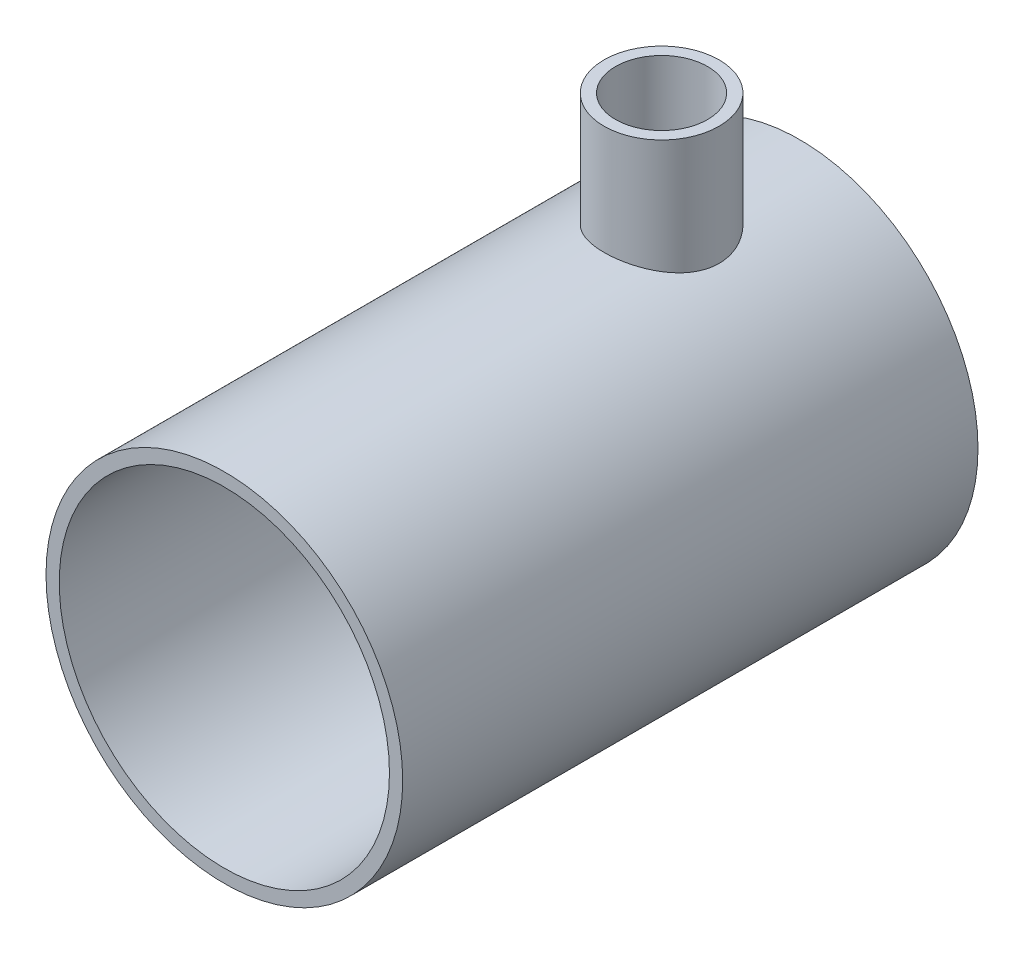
ISO-10303-21;
HEADER;
FILE_DESCRIPTION(('STEP AP214'),'2;1');
FILE_NAME('part.step','',(''),(''),'','','');
FILE_SCHEMA(('AUTOMOTIVE_DESIGN { 1 0 10303 214 1 1 1 1 }'));
ENDSEC;
DATA;
#1=APPLICATION_CONTEXT('core data for automotive mechanical design processes');
#2=APPLICATION_PROTOCOL_DEFINITION('international standard','automotive_design',2000,#1);
#3=PRODUCT_CONTEXT('',#1,'mechanical');
#4=PRODUCT('Part','Part','',(#3));
#5=PRODUCT_RELATED_PRODUCT_CATEGORY('part','',(#4));
#6=PRODUCT_DEFINITION_FORMATION('','',#4);
#7=PRODUCT_DEFINITION_CONTEXT('part definition',#1,'design');
#8=PRODUCT_DEFINITION('design','',#6,#7);
#9=PRODUCT_DEFINITION_SHAPE('','',#8);
#10=(LENGTH_UNIT() NAMED_UNIT(*) SI_UNIT(.MILLI.,.METRE.));
#11=(NAMED_UNIT(*) PLANE_ANGLE_UNIT() SI_UNIT($,.RADIAN.));
#12=(NAMED_UNIT(*) SI_UNIT($,.STERADIAN.) SOLID_ANGLE_UNIT());
#13=UNCERTAINTY_MEASURE_WITH_UNIT(LENGTH_MEASURE(1.E-05),#10,'distance_accuracy_value','');
#14=(GEOMETRIC_REPRESENTATION_CONTEXT(3) GLOBAL_UNCERTAINTY_ASSIGNED_CONTEXT((#13)) GLOBAL_UNIT_ASSIGNED_CONTEXT((#10,
#11,#12)) REPRESENTATION_CONTEXT('',''));
#15=CARTESIAN_POINT('',(0.,0.,0.));
#16=DIRECTION('',(0.,0.,1.));
#17=DIRECTION('',(1.,0.,0.));
#18=AXIS2_PLACEMENT_3D('',#15,#16,#17);
#19=CARTESIAN_POINT('',(0.,0.,50.));
#20=DIRECTION('',(0.,0.,-1.));
#21=DIRECTION('',(-1.,0.,0.));
#22=AXIS2_PLACEMENT_3D('',#19,#20,#21);
#23=CYLINDRICAL_SURFACE('',#22,15.5);
#24=CARTESIAN_POINT('',(0.,0.,0.));
#25=DIRECTION('',(0.,0.,1.));
#26=DIRECTION('',(1.,0.,0.));
#27=AXIS2_PLACEMENT_3D('',#24,#25,#26);
#28=CIRCLE('',#27,15.5);
#29=CARTESIAN_POINT('',(15.5,0.,0.));
#30=VERTEX_POINT('',#29);
#31=EDGE_CURVE('E37',#30,#30,#28,.T.);
#32=ORIENTED_EDGE('',*,*,#31,.T.);
#33=EDGE_LOOP('',(#32));
#34=FACE_BOUND('',#33,.T.);
#35=CARTESIAN_POINT('',(0.,0.,50.));
#36=DIRECTION('',(0.,0.,1.));
#37=DIRECTION('',(1.,0.,0.));
#38=AXIS2_PLACEMENT_3D('',#35,#36,#37);
#39=CIRCLE('',#38,15.5);
#40=CARTESIAN_POINT('',(15.5,0.,50.));
#41=VERTEX_POINT('',#40);
#42=EDGE_CURVE('E41',#41,#41,#39,.T.);
#43=ORIENTED_EDGE('',*,*,#42,.F.);
#44=EDGE_LOOP('',(#43));
#45=FACE_BOUND('',#44,.T.);
#46=CARTESIAN_POINT('',(0.,15.5,7.));
#47=CARTESIAN_POINT('',(-0.273308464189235,15.4999995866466,7.00000038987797));
#48=CARTESIAN_POINT('',(-0.546623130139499,15.4927037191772,7.02248266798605));
#49=CARTESIAN_POINT('',(-1.08523197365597,15.4643156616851,7.11156330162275));
#50=CARTESIAN_POINT('',(-1.35052480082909,15.4432211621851,7.17816904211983));
#51=CARTESIAN_POINT('',(-1.86524635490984,15.389534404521,7.35299702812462));
#52=CARTESIAN_POINT('',(-2.11469983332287,15.3569606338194,7.46115238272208));
#53=CARTESIAN_POINT('',(-2.59192902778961,15.2836601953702,7.71571638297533));
#54=CARTESIAN_POINT('',(-2.81970089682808,15.242932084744,7.86213180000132));
#55=CARTESIAN_POINT('',(-3.25454580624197,15.1561397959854,8.19409139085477));
#56=CARTESIAN_POINT('',(-3.46081152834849,15.1099537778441,8.38066109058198));
#57=CARTESIAN_POINT('',(-3.83973498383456,15.018139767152,8.78545124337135));
#58=CARTESIAN_POINT('',(-4.01238592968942,14.9725118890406,9.00367807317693));
#59=CARTESIAN_POINT('',(-4.32366580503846,14.8856572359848,9.47270948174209));
#60=CARTESIAN_POINT('',(-4.46126675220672,14.8445799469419,9.72422662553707));
#61=CARTESIAN_POINT('',(-4.69187659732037,14.7733194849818,10.2483713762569));
#62=CARTESIAN_POINT('',(-4.78489812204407,14.743133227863,10.5209929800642));
#63=CARTESIAN_POINT('',(-4.9207189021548,14.6983511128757,11.0704633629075));
#64=CARTESIAN_POINT('',(-4.9650231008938,14.6832894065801,11.3469010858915));
#65=CARTESIAN_POINT('',(-5.00685479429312,14.669081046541,11.9036649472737));
#66=CARTESIAN_POINT('',(-5.00439567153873,14.6699298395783,12.1839899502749));
#67=CARTESIAN_POINT('',(-4.95394348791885,14.6870367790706,12.7279405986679));
#68=CARTESIAN_POINT('',(-4.90788741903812,14.7026393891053,12.9917700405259));
#69=CARTESIAN_POINT('',(-4.77469847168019,14.7464273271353,13.5077360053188));
#70=CARTESIAN_POINT('',(-4.68756096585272,14.7746140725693,13.7598712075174));
#71=CARTESIAN_POINT('',(-4.47336280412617,14.8408797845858,14.2498037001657));
#72=CARTESIAN_POINT('',(-4.34571036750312,14.8791038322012,14.4873217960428));
#73=CARTESIAN_POINT('',(-4.05451678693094,14.961073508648,14.9381905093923));
#74=CARTESIAN_POINT('',(-3.89096581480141,15.0048206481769,15.1515344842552));
#75=CARTESIAN_POINT('',(-3.52320909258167,15.0955129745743,15.5589184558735));
#76=CARTESIAN_POINT('',(-3.31741156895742,15.1425101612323,15.751512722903));
#77=CARTESIAN_POINT('',(-2.87585745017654,15.2325358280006,16.099819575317));
#78=CARTESIAN_POINT('',(-2.64009833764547,15.275563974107,16.255529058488));
#79=CARTESIAN_POINT('',(-2.14239406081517,15.3533075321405,16.5267127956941));
#80=CARTESIAN_POINT('',(-1.88023727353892,15.3879466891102,16.6418220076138));
#81=CARTESIAN_POINT('',(-1.33890004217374,15.4444576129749,16.825868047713));
#82=CARTESIAN_POINT('',(-1.05972515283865,15.4663335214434,16.8948198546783));
#83=CARTESIAN_POINT('',(-0.504532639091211,15.494177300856,16.9820842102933));
#84=CARTESIAN_POINT('',(-0.228852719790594,15.5007590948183,17.0023521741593));
#85=CARTESIAN_POINT('',(0.322009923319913,15.4991009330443,16.9972139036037));
#86=CARTESIAN_POINT('',(0.597192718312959,15.4908633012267,16.9718148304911));
#87=CARTESIAN_POINT('',(1.13157213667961,15.4608962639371,16.8776229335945));
#88=CARTESIAN_POINT('',(1.39099953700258,15.4395342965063,16.81001111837));
#89=CARTESIAN_POINT('',(1.89474114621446,15.3858433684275,16.6347709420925));
#90=CARTESIAN_POINT('',(2.13905345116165,15.3535130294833,16.5271375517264));
#91=CARTESIAN_POINT('',(2.61252171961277,15.2801705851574,16.2718725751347));
#92=CARTESIAN_POINT('',(2.84113683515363,15.2389592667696,16.1232966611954));
#93=CARTESIAN_POINT('',(3.27083673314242,15.1525490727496,15.7914856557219));
#94=CARTESIAN_POINT('',(3.47191356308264,15.10734905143,15.6082405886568));
#95=CARTESIAN_POINT('',(3.84968836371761,15.0156357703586,15.2030937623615));
#96=CARTESIAN_POINT('',(4.02499150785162,14.9691480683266,14.9798825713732));
#97=CARTESIAN_POINT('',(4.33580042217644,14.8821024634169,14.506205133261));
#98=CARTESIAN_POINT('',(4.47130640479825,14.8415445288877,14.2557390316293));
#99=CARTESIAN_POINT('',(4.69792389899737,14.7713785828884,13.734902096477));
#100=CARTESIAN_POINT('',(4.78917156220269,14.7417370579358,13.4645952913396));
#101=CARTESIAN_POINT('',(4.92448763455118,14.6970948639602,12.9112887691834));
#102=CARTESIAN_POINT('',(4.96857554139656,14.6820881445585,12.6282943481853));
#103=CARTESIAN_POINT('',(5.00686161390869,14.669072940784,12.0723052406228));
#104=CARTESIAN_POINT('',(5.0033605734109,14.6702805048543,11.7994854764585));
#105=CARTESIAN_POINT('',(4.952174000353,14.687637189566,11.2585318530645));
#106=CARTESIAN_POINT('',(4.90449079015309,14.7037855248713,10.990397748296));
#107=CARTESIAN_POINT('',(4.76787683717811,14.7486389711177,10.4708380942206));
#108=CARTESIAN_POINT('',(4.67964567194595,14.7771306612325,10.2192087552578));
#109=CARTESIAN_POINT('',(4.46499823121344,14.8433941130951,9.73412744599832));
#110=CARTESIAN_POINT('',(4.33857383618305,14.8811678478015,9.5006793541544));
#111=CARTESIAN_POINT('',(4.04502779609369,14.9636852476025,9.04814254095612));
#112=CARTESIAN_POINT('',(3.87644081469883,15.008652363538,8.83004525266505));
#113=CARTESIAN_POINT('',(3.50588508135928,15.0995070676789,8.42449224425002));
#114=CARTESIAN_POINT('',(3.30390716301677,15.1453949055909,8.23704496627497));
#115=CARTESIAN_POINT('',(2.86365656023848,15.234881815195,7.89140807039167));
#116=CARTESIAN_POINT('',(2.62434750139,15.2783411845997,7.73449809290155));
#117=CARTESIAN_POINT('',(2.12135464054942,15.3562521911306,7.46332540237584));
#118=CARTESIAN_POINT('',(1.85767888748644,15.3907067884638,7.3490486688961));
#119=CARTESIAN_POINT('',(1.33127750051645,15.4448389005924,7.17303437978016));
#120=CARTESIAN_POINT('',(1.06962325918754,15.465337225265,7.10834311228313));
#121=CARTESIAN_POINT('',(0.538646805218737,15.4929163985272,7.02183077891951));
#122=CARTESIAN_POINT('',(0.269326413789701,15.5000004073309,6.99999961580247));
#123=CARTESIAN_POINT('',(0.,15.5,7.));
#124=B_SPLINE_CURVE_WITH_KNOTS('',3,(#46,#47,#48,#49,#50,#51,#52,#53,#54,#55,#56,#57,#58,#59,
#60,#61,#62,#63,#64,#65,#66,#67,#68,#69,#70,#71,#72,#73,#74,#75,#76,#77,#78,#79,#80,#81,#82,#83,
#84,#85,#86,#87,#88,#89,#90,#91,#92,#93,#94,#95,#96,#97,#98,#99,#100,#101,#102,#103,#104,#105,
#106,#107,#108,#109,#110,#111,#112,#113,#114,#115,#116,#117,#118,#119,#120,#121,#122,#123),
.UNSPECIFIED.,.T.,.F.,(4,2,2,2,2,2,2,2,2,2,2,2,2,2,2,2,2,2,2,2,2,2,2,2,2,2,2,2,2,2,2,2,2,2,2,2,
2,2,4),(0.,0.818934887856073,1.63800687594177,2.45576572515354,3.27366940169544,
4.11566491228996,4.95783026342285,5.82241350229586,6.68675170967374,7.52356606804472,
8.36014095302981,9.16120972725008,9.96236875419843,10.7758146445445,11.5894835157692,
12.4427707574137,13.2961297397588,14.1569767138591,15.0175441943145,15.8429218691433,
16.6681701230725,17.4713051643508,18.2745411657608,19.0981285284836,19.921953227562,
20.7807016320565,21.6394454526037,22.4955304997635,23.3512614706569,24.1657736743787,
24.9802430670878,25.7811593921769,26.5822461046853,27.4164224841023,28.2508282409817,
29.1149487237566,29.9787847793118,30.7859781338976,31.5929813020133),.UNSPECIFIED.);
#125=CARTESIAN_POINT('',(0.,15.5,7.));
#126=VERTEX_POINT('',#125);
#127=EDGE_CURVE('E10',#126,#126,#124,.T.);
#128=ORIENTED_EDGE('',*,*,#127,.F.);
#129=EDGE_LOOP('',(#128));
#130=FACE_BOUND('',#129,.T.);
#131=ADVANCED_FACE('F33',(#34,#45,#130),#23,.T.);
#132=CARTESIAN_POINT('',(0.,0.,50.));
#133=DIRECTION('',(0.,0.,-1.));
#134=DIRECTION('',(-1.,0.,0.));
#135=AXIS2_PLACEMENT_3D('',#132,#133,#134);
#136=CYLINDRICAL_SURFACE('',#135,14.35);
#137=CARTESIAN_POINT('',(0.,14.35,16.));
#138=CARTESIAN_POINT('',(0.220133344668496,14.3499970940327,15.9999955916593));
#139=CARTESIAN_POINT('',(0.440312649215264,14.3448852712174,15.9817672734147));
#140=CARTESIAN_POINT('',(0.874304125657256,14.3249906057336,15.9094799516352));
#141=CARTESIAN_POINT('',(1.08811360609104,14.3102037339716,15.8554060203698));
#142=CARTESIAN_POINT('',(1.50304006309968,14.2725869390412,15.713340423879));
#143=CARTESIAN_POINT('',(1.70417381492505,14.249767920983,15.6253947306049));
#144=CARTESIAN_POINT('',(2.08883860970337,14.1984843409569,15.4182589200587));
#145=CARTESIAN_POINT('',(2.2723680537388,14.1700192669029,15.2990659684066));
#146=CARTESIAN_POINT('',(2.6212279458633,14.1097037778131,15.0296576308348));
#147=CARTESIAN_POINT('',(2.7860529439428,14.0777913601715,14.8788016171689));
#148=CARTESIAN_POINT('',(3.08842266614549,14.0145658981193,14.5517173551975));
#149=CARTESIAN_POINT('',(3.22596352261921,13.9832529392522,14.375485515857));
#150=CARTESIAN_POINT('',(3.47239273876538,13.9241301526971,13.9985333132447));
#151=CARTESIAN_POINT('',(3.58068728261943,13.8963981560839,13.7974114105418));
#152=CARTESIAN_POINT('',(3.7617202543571,13.848494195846,13.3789153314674));
#153=CARTESIAN_POINT('',(3.83446591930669,13.8283206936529,13.1615444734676));
#154=CARTESIAN_POINT('',(3.94055714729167,13.7984600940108,12.7223472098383));
#155=CARTESIAN_POINT('',(3.9748246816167,13.7885281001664,12.5007605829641));
#156=CARTESIAN_POINT('',(4.0058630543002,13.7795444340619,12.054778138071));
#157=CARTESIAN_POINT('',(4.00264160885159,13.7804905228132,11.8303829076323));
#158=CARTESIAN_POINT('',(3.95952267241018,13.792937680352,11.3924519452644));
#159=CARTESIAN_POINT('',(3.92075422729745,13.8041138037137,11.1787943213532));
#160=CARTESIAN_POINT('',(3.80945563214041,13.8352395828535,10.7611436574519));
#161=CARTESIAN_POINT('',(3.73692256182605,13.8551899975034,10.5571514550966));
#162=CARTESIAN_POINT('',(3.55926507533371,13.9018928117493,10.1617430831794));
#163=CARTESIAN_POINT('',(3.45375532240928,13.9287249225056,9.97050986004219));
#164=CARTESIAN_POINT('',(3.21340791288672,13.9861265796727,9.60807244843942));
#165=CARTESIAN_POINT('',(3.07856400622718,14.0166969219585,9.43687254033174));
#166=CARTESIAN_POINT('',(2.77766087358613,14.0794710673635,9.11292656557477));
#167=CARTESIAN_POINT('',(2.61065729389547,14.1116941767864,8.96106008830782));
#168=CARTESIAN_POINT('',(2.25315512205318,14.1731662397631,8.68730006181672));
#169=CARTESIAN_POINT('',(2.06265542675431,14.2024150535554,8.56540792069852));
#170=CARTESIAN_POINT('',(1.66212420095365,14.2548514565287,8.35461906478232));
#171=CARTESIAN_POINT('',(1.45199788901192,14.2780073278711,8.26589403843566));
#172=CARTESIAN_POINT('',(1.01901591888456,14.3154200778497,8.12528931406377));
#173=CARTESIAN_POINT('',(0.796163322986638,14.3296790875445,8.07340079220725));
#174=CARTESIAN_POINT('',(0.351551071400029,14.3473640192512,8.00935206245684));
#175=CARTESIAN_POINT('',(0.129976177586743,14.3511155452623,7.99599736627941));
#176=CARTESIAN_POINT('',(-0.312251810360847,14.3483056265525,8.00607942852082));
#177=CARTESIAN_POINT('',(-0.532905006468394,14.3417453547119,8.02951200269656));
#178=CARTESIAN_POINT('',(-0.962677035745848,14.3192603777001,8.11152805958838));
#179=CARTESIAN_POINT('',(-1.17193545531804,14.3035162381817,8.16943419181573));
#180=CARTESIAN_POINT('',(-1.57773932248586,14.2644603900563,8.31795716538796));
#181=CARTESIAN_POINT('',(-1.77428332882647,14.2411478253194,8.40857770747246));
#182=CARTESIAN_POINT('',(-2.15363493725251,14.1887919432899,8.62209818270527));
#183=CARTESIAN_POINT('',(-2.33606953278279,14.1596390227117,8.74563325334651));
#184=CARTESIAN_POINT('',(-2.67803462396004,14.0989660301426,9.02068729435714));
#185=CARTESIAN_POINT('',(-2.83756015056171,14.0674454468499,9.17221231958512));
#186=CARTESIAN_POINT('',(-3.13429362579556,14.0043729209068,9.50453604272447));
#187=CARTESIAN_POINT('',(-3.27065581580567,13.9728503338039,9.68609698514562));
#188=CARTESIAN_POINT('',(-3.51100982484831,13.9144050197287,10.0702004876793));
#189=CARTESIAN_POINT('',(-3.61500286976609,13.8874821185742,10.2727422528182));
#190=CARTESIAN_POINT('',(-3.78689482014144,13.8415984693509,10.6921445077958));
#191=CARTESIAN_POINT('',(-3.85499307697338,13.8225938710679,10.9089182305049));
#192=CARTESIAN_POINT('',(-3.95357558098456,13.7947241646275,11.3514681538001));
#193=CARTESIAN_POINT('',(-3.9840705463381,13.7858561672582,11.5772417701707));
#194=CARTESIAN_POINT('',(-4.00592341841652,13.7795206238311,12.022680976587));
#195=CARTESIAN_POINT('',(-3.99864705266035,13.7816552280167,12.2422748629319));
#196=CARTESIAN_POINT('',(-3.94836404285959,13.7961440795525,12.6769719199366));
#197=CARTESIAN_POINT('',(-3.90535848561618,13.8084980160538,12.8920752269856));
#198=CARTESIAN_POINT('',(-3.78566258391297,13.8417858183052,13.3097873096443));
#199=CARTESIAN_POINT('',(-3.70928689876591,13.8626394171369,13.5124931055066));
#200=CARTESIAN_POINT('',(-3.52526211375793,13.9105725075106,13.9023715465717));
#201=CARTESIAN_POINT('',(-3.41760770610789,13.9376530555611,14.0895415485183));
#202=CARTESIAN_POINT('',(-3.17004928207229,13.9960682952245,14.449491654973));
#203=CARTESIAN_POINT('',(-3.02922549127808,14.0275111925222,14.6216216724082));
#204=CARTESIAN_POINT('',(-2.72104207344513,14.090533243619,14.9402505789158));
#205=CARTESIAN_POINT('',(-2.55367586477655,14.1221124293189,15.0867430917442));
#206=CARTESIAN_POINT('',(-2.19230819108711,14.182757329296,15.3534171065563));
#207=CARTESIAN_POINT('',(-1.99776334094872,14.2117444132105,15.4728817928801));
#208=CARTESIAN_POINT('',(-1.59054484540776,14.2630522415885,15.6772262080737));
#209=CARTESIAN_POINT('',(-1.37788184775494,14.2853768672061,15.7621260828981));
#210=CARTESIAN_POINT('',(-0.971964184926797,14.3182801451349,15.8850490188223));
#211=CARTESIAN_POINT('',(-0.780302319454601,14.3300844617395,15.9280499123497));
#212=CARTESIAN_POINT('',(-0.392438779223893,14.3459452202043,15.9855256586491));
#213=CARTESIAN_POINT('',(-0.196237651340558,14.3500025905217,16.0000039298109));
#214=CARTESIAN_POINT('',(0.,14.35,16.));
#215=B_SPLINE_CURVE_WITH_KNOTS('',3,(#137,#138,#139,#140,#141,#142,#143,#144,#145,#146,#147,
#148,#149,#150,#151,#152,#153,#154,#155,#156,#157,#158,#159,#160,#161,#162,#163,#164,#165,#166,
#167,#168,#169,#170,#171,#172,#173,#174,#175,#176,#177,#178,#179,#180,#181,#182,#183,#184,#185,
#186,#187,#188,#189,#190,#191,#192,#193,#194,#195,#196,#197,#198,#199,#200,#201,#202,#203,#204,
#205,#206,#207,#208,#209,#210,#211,#212,#213,#214),.UNSPECIFIED.,.T.,.F.,(4,2,2,2,2,2,2,2,2,2,2,
2,2,2,2,2,2,2,2,2,2,2,2,2,2,2,2,2,2,2,2,2,2,2,2,2,2,2,4),(0.,0.659679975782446,1.31963484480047,
1.97869713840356,2.63781923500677,3.31184776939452,3.98597178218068,4.67289949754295,
5.35968730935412,6.02964241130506,6.69945962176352,7.34871244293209,7.99802142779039,
8.6552207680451,9.31256027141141,9.99342236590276,10.6743164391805,11.3586878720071,
12.0428953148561,12.7056528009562,13.368334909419,14.0184072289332,14.6685531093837,
15.332288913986,15.9961684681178,16.680640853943,17.3650873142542,18.0456913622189,
18.7261013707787,19.3820844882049,20.0380476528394,20.6879546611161,21.3379720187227,
22.0087393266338,22.6796732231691,23.3667290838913,24.0533839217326,24.6415254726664,
25.2295965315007),.UNSPECIFIED.);
#216=CARTESIAN_POINT('',(0.,14.35,16.));
#217=VERTEX_POINT('',#216);
#218=EDGE_CURVE('E99',#217,#217,#215,.T.);
#219=ORIENTED_EDGE('',*,*,#218,.T.);
#220=EDGE_LOOP('',(#219));
#221=FACE_BOUND('',#220,.T.);
#222=CARTESIAN_POINT('',(0.,0.,0.));
#223=DIRECTION('',(0.,0.,1.));
#224=DIRECTION('',(1.,0.,0.));
#225=AXIS2_PLACEMENT_3D('',#222,#223,#224);
#226=CIRCLE('',#225,14.35);
#227=CARTESIAN_POINT('',(14.35,0.,0.));
#228=VERTEX_POINT('',#227);
#229=EDGE_CURVE('E91',#228,#228,#226,.T.);
#230=ORIENTED_EDGE('',*,*,#229,.F.);
#231=EDGE_LOOP('',(#230));
#232=FACE_BOUND('',#231,.T.);
#233=CARTESIAN_POINT('',(0.,0.,50.));
#234=DIRECTION('',(0.,0.,1.));
#235=DIRECTION('',(1.,0.,0.));
#236=AXIS2_PLACEMENT_3D('',#233,#234,#235);
#237=CIRCLE('',#236,14.35);
#238=CARTESIAN_POINT('',(14.35,0.,50.));
#239=VERTEX_POINT('',#238);
#240=EDGE_CURVE('E53',#239,#239,#237,.T.);
#241=ORIENTED_EDGE('',*,*,#240,.T.);
#242=EDGE_LOOP('',(#241));
#243=FACE_BOUND('',#242,.T.);
#244=ADVANCED_FACE('F64',(#221,#232,#243),#136,.F.);
#245=CARTESIAN_POINT('',(0.,0.,50.));
#246=DIRECTION('',(0.,0.,1.));
#247=DIRECTION('',(1.,0.,0.));
#248=AXIS2_PLACEMENT_3D('',#245,#246,#247);
#249=PLANE('',#248);
#250=ORIENTED_EDGE('',*,*,#42,.T.);
#251=EDGE_LOOP('',(#250));
#252=FACE_BOUND('',#251,.T.);
#253=ORIENTED_EDGE('',*,*,#240,.F.);
#254=EDGE_LOOP('',(#253));
#255=FACE_BOUND('',#254,.T.);
#256=ADVANCED_FACE('F67',(#252,#255),#249,.T.);
#257=CARTESIAN_POINT('',(0.,0.,0.));
#258=DIRECTION('',(0.,0.,1.));
#259=DIRECTION('',(1.,0.,0.));
#260=AXIS2_PLACEMENT_3D('',#257,#258,#259);
#261=PLANE('',#260);
#262=ORIENTED_EDGE('',*,*,#31,.F.);
#263=EDGE_LOOP('',(#262));
#264=FACE_BOUND('',#263,.T.);
#265=ORIENTED_EDGE('',*,*,#229,.T.);
#266=EDGE_LOOP('',(#265));
#267=FACE_BOUND('',#266,.T.);
#268=ADVANCED_FACE('F61',(#264,#267),#261,.F.);
#269=CARTESIAN_POINT('',(0.,25.,12.));
#270=DIRECTION('',(0.,-1.,0.));
#271=DIRECTION('',(0.,0.,-1.));
#272=AXIS2_PLACEMENT_3D('',#269,#270,#271);
#273=CYLINDRICAL_SURFACE('',#272,5.);
#274=CARTESIAN_POINT('',(0.,25.,12.));
#275=DIRECTION('',(0.,1.,0.));
#276=DIRECTION('',(0.,0.,1.));
#277=AXIS2_PLACEMENT_3D('',#274,#275,#276);
#278=CIRCLE('',#277,5.);
#279=CARTESIAN_POINT('',(0.,25.,17.));
#280=VERTEX_POINT('',#279);
#281=EDGE_CURVE('E51',#280,#280,#278,.T.);
#282=ORIENTED_EDGE('',*,*,#281,.F.);
#283=EDGE_LOOP('',(#282));
#284=FACE_BOUND('',#283,.T.);
#285=ORIENTED_EDGE('',*,*,#127,.T.);
#286=EDGE_LOOP('',(#285));
#287=FACE_BOUND('',#286,.T.);
#288=ADVANCED_FACE('F55',(#284,#287),#273,.T.);
#289=CARTESIAN_POINT('',(0.,25.,12.));
#290=DIRECTION('',(0.,1.,0.));
#291=DIRECTION('',(0.,0.,1.));
#292=AXIS2_PLACEMENT_3D('',#289,#290,#291);
#293=PLANE('',#292);
#294=CARTESIAN_POINT('',(0.,25.,12.));
#295=DIRECTION('',(0.,1.,0.));
#296=DIRECTION('',(0.,0.,1.));
#297=AXIS2_PLACEMENT_3D('',#294,#295,#296);
#298=CIRCLE('',#297,4.);
#299=CARTESIAN_POINT('',(0.,25.,16.));
#300=VERTEX_POINT('',#299);
#301=EDGE_CURVE('E95',#300,#300,#298,.T.);
#302=ORIENTED_EDGE('',*,*,#301,.F.);
#303=EDGE_LOOP('',(#302));
#304=FACE_BOUND('',#303,.T.);
#305=ORIENTED_EDGE('',*,*,#281,.T.);
#306=EDGE_LOOP('',(#305));
#307=FACE_BOUND('',#306,.T.);
#308=ADVANCED_FACE('F60',(#304,#307),#293,.T.);
#309=CARTESIAN_POINT('',(0.,-15.501,12.));
#310=DIRECTION('',(0.,1.,0.));
#311=DIRECTION('',(0.,0.,1.));
#312=AXIS2_PLACEMENT_3D('',#309,#310,#311);
#313=CYLINDRICAL_SURFACE('',#312,4.);
#314=ORIENTED_EDGE('',*,*,#218,.F.);
#315=EDGE_LOOP('',(#314));
#316=FACE_BOUND('',#315,.T.);
#317=ORIENTED_EDGE('',*,*,#301,.T.);
#318=EDGE_LOOP('',(#317));
#319=FACE_BOUND('',#318,.T.);
#320=ADVANCED_FACE('F107',(#316,#319),#313,.F.);
#321=CLOSED_SHELL('',(#131,#244,#256,#268,#288,#308,#320));
#322=MANIFOLD_SOLID_BREP('B2',#321);
#323=ADVANCED_BREP_SHAPE_REPRESENTATION('',(#18,#322),#14);
#324=SHAPE_DEFINITION_REPRESENTATION(#9,#323);
ENDSEC;
END-ISO-10303-21;
